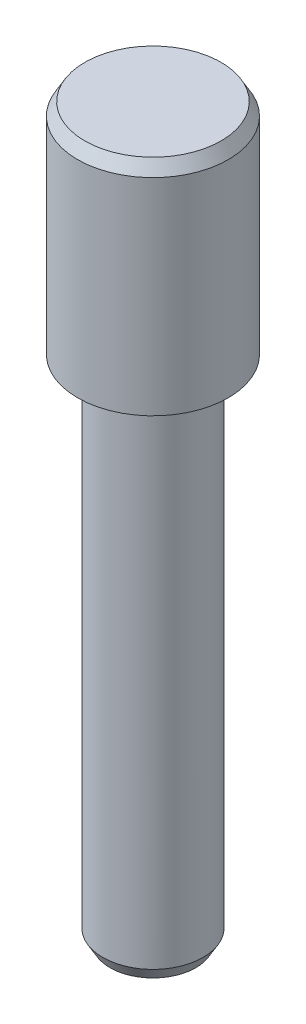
from build123d import *
from OCP.BRepFilletAPI import BRepFilletAPI_MakeChamfer

# Parameters (mm, degrees)
ESQUISSE1_R        = 3
BOSS_EXTRU_1_DEPTH = 9
CHANFREIN1_SIZE    = 0.5
CHANFREIN1_SIZE2   = 0.288675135
ESQUISSE2_R        = 2
BOSS_EXTRU_2_DEPTH = 20
CHANFREIN2_SIZE    = 0.5
CHANFREIN2_SIZE2   = 0.288675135


with BuildPart() as part:
    # Esquisse1 → Boss.-Extru.1 (new body)
    with BuildSketch(Plane(origin=(0, 0, 0), x_dir=(1, 0, 0), z_dir=(0, 1, 0))):
        with Locations(Location((0, 0, 0), (0, 0, 270))):
            Circle(ESQUISSE1_R)
    extrude(amount=-BOSS_EXTRU_1_DEPTH)

    # Chanfrein1: one chamfer whose edges measure the first distance from different faces: ONE call of the kernel's chamfer builder (chamfer() names one face for all edges)
    chanfrein1_edges_1 = [part.edges().sort_by_distance(p)[0] for p in [
        (0, 0, -3),
    ]]
    chanfrein1_side_1 = [part.faces().sort_by_distance(p)[0] for p in [
        (0, -4.5, -3),
    ]]
    chanfrein1_edges_2 = [part.edges().sort_by_distance(p)[0] for p in [
        (0, -9, -3),
    ]]
    chanfrein1_side_2 = [part.faces().sort_by_distance(p)[0] for p in [
        (0, -9, 0),
    ]]
    chanfrein1 = BRepFilletAPI_MakeChamfer(part.part.solid().wrapped)
    for e in chanfrein1_edges_1:
        chanfrein1.Add(CHANFREIN1_SIZE, CHANFREIN1_SIZE2, e.wrapped, chanfrein1_side_1[0].wrapped)  # the first distance lies on this face
    for e in chanfrein1_edges_2:
        chanfrein1.Add(CHANFREIN1_SIZE, CHANFREIN1_SIZE2, e.wrapped, chanfrein1_side_2[0].wrapped)  # the first distance lies on this face
    add(Compound.cast(chanfrein1.Shape()), mode=Mode.REPLACE)

    # Esquisse2 → Boss.-Extru.2 (add)
    with BuildSketch(Plane.XZ.offset(9)):
        with Locations(Location((0, 0, 0), (0, 0, 90))):
            Circle(ESQUISSE2_R)
    extrude(amount=BOSS_EXTRU_2_DEPTH)

    # Chanfrein2
    chanfrein2_edges = [part.edges().sort_by_distance(p)[0] for p in [
        (0, -29, -2),
    ]]
    chanfrein2_side = [part.faces().sort_by_distance(p)[0] for p in [
        (0, -19, -2),
    ]]
    chamfer(chanfrein2_edges, length=CHANFREIN2_SIZE, length2=CHANFREIN2_SIZE2, reference=chanfrein2_side[0])


solid = part.part
